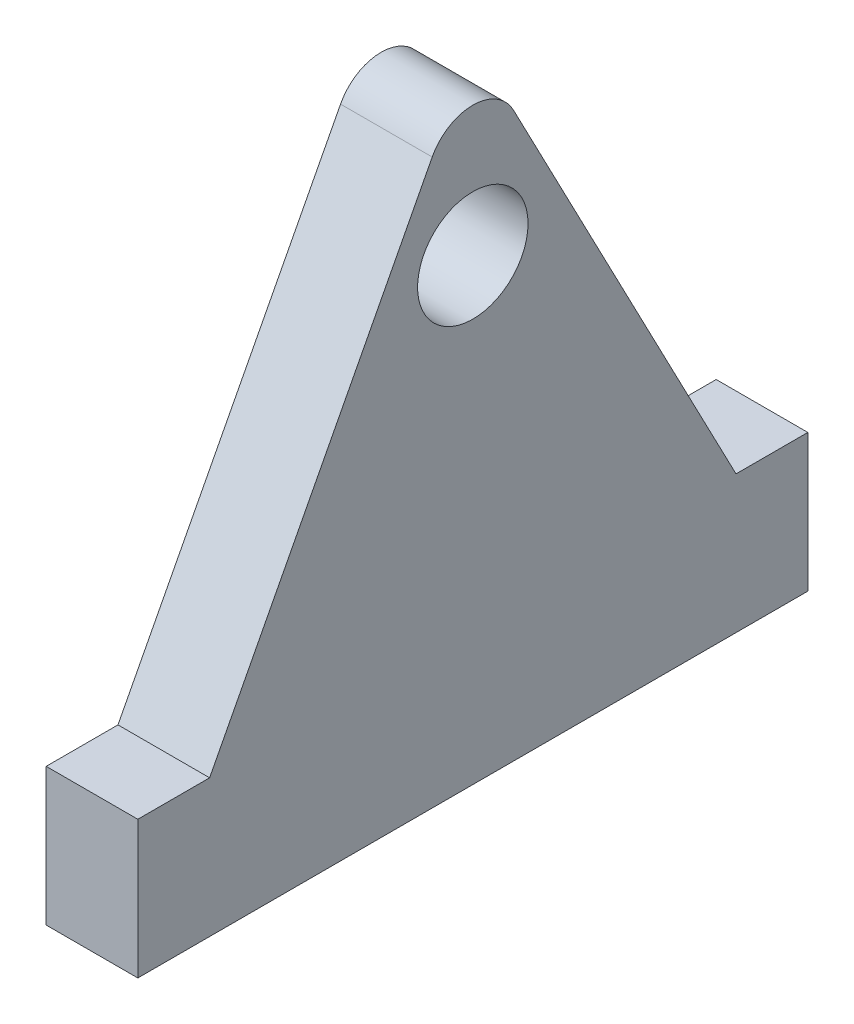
from build123d import *

# Parameters (mm, degrees)
BOSS_EXTRUDE1_DEPTH     = 30
SKETCH3_W               = 30
SKETCH3_H               = 146.199261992
BOSS_EXTRUDE2_DEPTH     = 30
CUT_EXTRUDE5_DEPTH      = 165.846062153
CUT_EXTRUDE5_DEPTH_BACK = 165.846062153
SKETCH6_W               = 10
SKETCH6_H               = 133.245058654
CUT_EXTRUDE6_DEPTH      = 104.167611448
CUT_EXTRUDE6_DEPTH_BACK = 104.167611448
SKETCH2_R               = 12.05


with BuildPart() as part:
    # Sketch1 → Boss-Extrude1 (new body)
    with BuildSketch(Plane(origin=(0, 0, 0), x_dir=(0, 0, -1), z_dir=(1, 0, 0))):
        with BuildLine():
            Line((-8.864389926, 53.02297053), (-73.099630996, -70))
            Line((-73.099630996, -70), (73.099630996, -70))
            Line((73.099630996, -70), (8.864389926, 53.02297053))
            ThreePointArc((8.864389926, 53.02297053), (0, 58.394516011), (-8.864389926, 53.02297053))
        make_face()
    extrude(amount=BOSS_EXTRUDE1_DEPTH)

    # Sketch3 → Boss-Extrude2 (add)
    with BuildSketch(Plane.XZ.offset(70)):
        with Locations((15, 0)):
            Rectangle(SKETCH3_W, SKETCH3_H)
    extrude(amount=-BOSS_EXTRUDE2_DEPTH)

    # Sketch6 → Cut-Extrude5 (cut, two sides: drawn at the far end of the back side and taken through both)
    with BuildSketch(Plane(origin=(0, 0, -73.099630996), x_dir=(-1, 0, 0), z_dir=(0, 0, -1)).offset(-CUT_EXTRUDE5_DEPTH_BACK)):
        with Locations((-5, -3.377470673)):
            Rectangle(SKETCH6_W, SKETCH6_H)
    extrude(amount=CUT_EXTRUDE5_DEPTH + CUT_EXTRUDE5_DEPTH_BACK, mode=Mode.SUBTRACT)

    # Sketch2 → Cut-Extrude6 (cut, two sides: drawn at the far end of the back side and taken through both)
    with BuildSketch(Plane(origin=(30, 0, 0), x_dir=(0, 0, -1), z_dir=(1, 0, 0)).offset(-CUT_EXTRUDE6_DEPTH_BACK)):
        with Locations((0, 30)):
            Circle(SKETCH2_R)
    extrude(amount=CUT_EXTRUDE6_DEPTH + CUT_EXTRUDE6_DEPTH_BACK, mode=Mode.SUBTRACT)


solid = part.part
